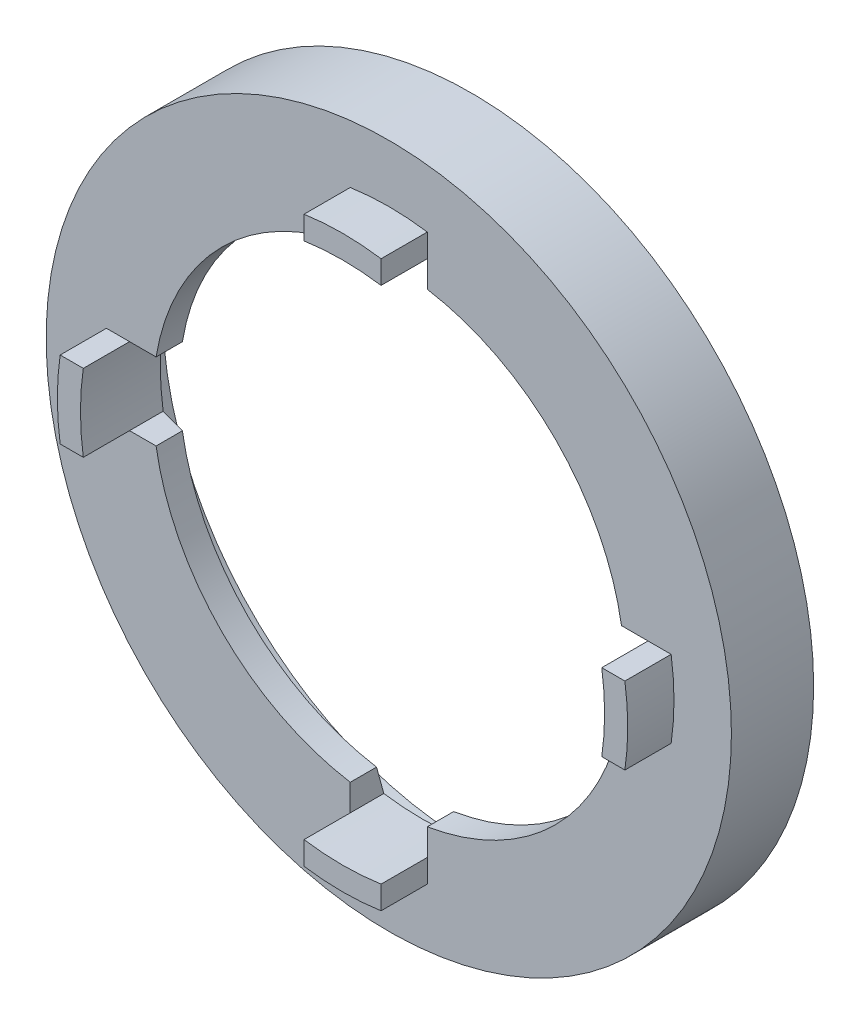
from build123d import *

# Parameters (mm, degrees)
SKETCH1_R           = 22.225
BOSS_EXTRUDE1_DEPTH = 5.334
CUT_EXTRUDE1_REACH  = 33.88
SKETCH2_R           = 15.3
BOSS_EXTRUDE2_DEPTH = 3
CUT_EXTRUDE2_DEPTH  = 32.880288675
CIRPATTERN1_COUNT   = 4


with BuildPart() as part:
    # Sketch1 → Boss-Extrude1 (new body)
    with BuildSketch(Plane.XY):
        Circle(SKETCH1_R)
    extrude(amount=BOSS_EXTRUDE1_DEPTH)

    # Sketch2 → Cut-Extrude1 (cut, up to next)
    with BuildSketch(Plane.XY.offset(5.334), mode=Mode.PRIVATE) as cut_extrude1_sk1:
        Circle(SKETCH2_R)
    cut_extrude1_tool1 = extrude(cut_extrude1_sk1.sketch, amount=-CUT_EXTRUDE1_REACH, mode=Mode.PRIVATE) & part.part
    add(cut_extrude1_tool1.solids().sort_by_distance((0, 0, 5.334))[0], mode=Mode.SUBTRACT)

    # Sketch3 → Cut-Revolve1 (revolve, cut)
    with BuildSketch(Plane(origin=(0, 0, 0), x_dir=(1, 0, 0), z_dir=(0, 1, 0)), mode=Mode.PRIVATE) as cut_revolve1_sk:
        Polygon((-17, -3.1564123), (-20, -3.1564123), (-20, 0), (-15, 0), (-15, -3.7115877), align=None)
    revolve(cut_revolve1_sk.sketch.rotate(Axis((0, 0, -1.424421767), (0, 0, -1)), 180), axis=Axis((0, 0, -1.424421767), (0, 0, -1)), mode=Mode.SUBTRACT)

    # Sketch4 → Boss-Extrude2 (add)
    with BuildSketch(Plane.XY.offset(5.334)):
        with BuildLine():
            Line((-18.315171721, 2.5), (-16.815171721, 2.5))
            ThreePointArc((-16.815171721, 2.5), (-17, 0), (-16.815171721, -2.5))
            Line((-16.815171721, -2.5), (-18.315171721, -2.5))
            ThreePointArc((-18.315171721, -2.5), (-18.5, 0), (-18.315171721, 2.5))
        make_face()
    boss_extrude2 = extrude(amount=BOSS_EXTRUDE2_DEPTH)

    # Sketch5 → Cut-Extrude2 (cut, through all)
    with BuildSketch(Plane.XY.offset(5.334)):
        with BuildLine():
            Line((-16.815171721, 2.5), (-15.094369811, 2.5))
            Line((-15.094369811, 2.5), (-15.094369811, -2.5))
            Line((-15.094369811, -2.5), (-16.815171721, -2.5))
            ThreePointArc((-16.815171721, -2.5), (-17, 0), (-16.815171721, 2.5))
        make_face()
    cut_extrude2 = extrude(amount=-CUT_EXTRUDE2_DEPTH, mode=Mode.SUBTRACT)

    # CirPattern1: Boss-Extrude2, Cut-Extrude2 ×4 about axis
    cirpattern1_axis = Axis((0, 0, 0), (0, 0, 1))
    add([boss_extrude2.rotate(cirpattern1_axis, i * 360 / CIRPATTERN1_COUNT) for i in range(1, CIRPATTERN1_COUNT)])
    add([cut_extrude2.rotate(cirpattern1_axis, i * 360 / CIRPATTERN1_COUNT) for i in range(1, CIRPATTERN1_COUNT)], mode=Mode.SUBTRACT)


solid = part.part
